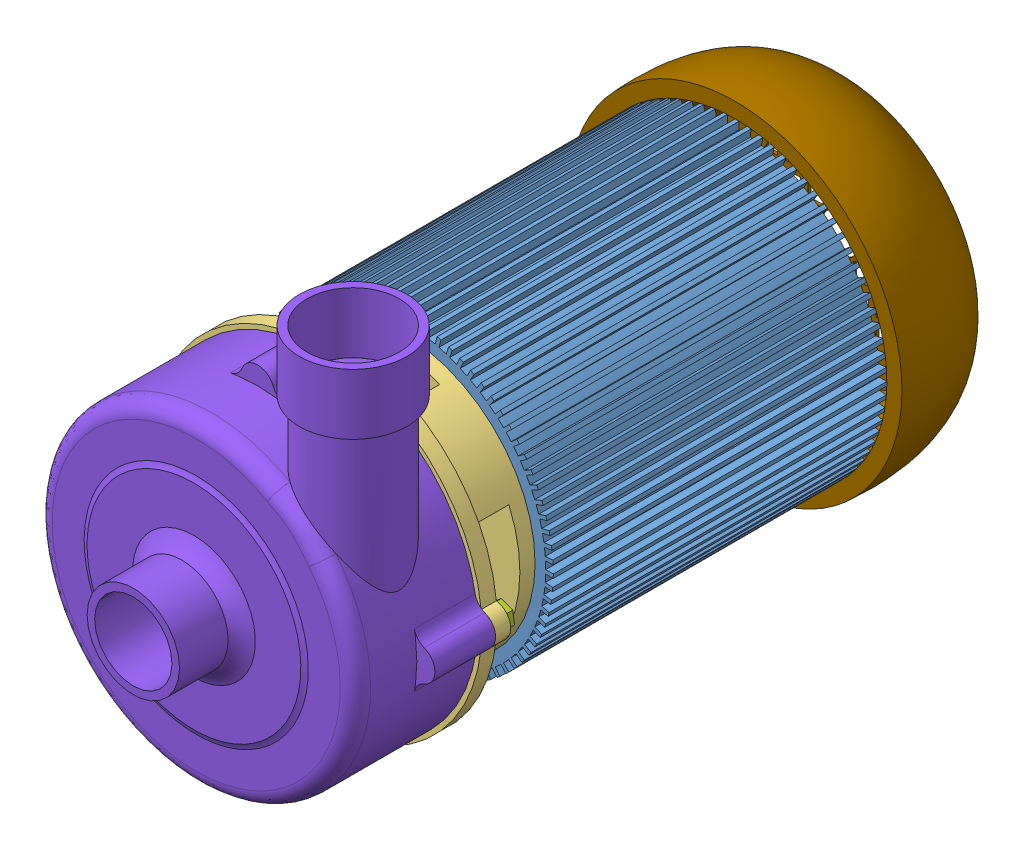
SolidWorks assembly BOMBA 5 HP.SLDASM, configuration Predeterminado (file format 4400). Lengths in mm.
Overall size (234 292 467).
16 component instances, 9 part files, 32 mates.
Components (placement in the parent):
- CARCASA MOTOR 5HP-1: CARCASA MOTOR 5HP.SLDPRT [Predeterminado] at (-10.3548 6.3831 -98.1182) size (200 200 243.76)
- EJE MOTOR 5 HP-1: EJE MOTOR 5 HP.SLDPRT [Predeterminado] at (-10.3548 6.3831 151.8818) x (-0.945086 0.326823 0) z (0 0 -1) size (35 35 180)
- PLATO SELLO 5 HP-1: PLATO SELLO 5 HP.SLDPRT [Predeterminado] at (-10.3548 6.3831 176.8818) x (-1 0 0) z (0 0 -1) size (234 234 65)
- TORNILLO MOTOR-1: TORNILLO MOTOR.SLDPRT [Predeterminado] at (-10.3548 64.3831 136.8818) x (-0.923728 -0.383049 0) z (0 0 -1) size (13.25 14.99 30)
- TORNILLO MOTOR-2: TORNILLO MOTOR.SLDPRT [Predeterminado] at (-68.3548 6.3831 136.8818) x (-0.923728 -0.383049 0) z (0 0 -1) size (13.25 14.99 30)
- TORNILLO MOTOR-3: TORNILLO MOTOR.SLDPRT [Predeterminado] at (-10.3548 -51.6169 136.8818) x (-0.95507 0.29638 0) z (0 0 -1) size (13.25 14.99 30)
- TORNILLO MOTOR-4: TORNILLO MOTOR.SLDPRT [Predeterminado] at (47.6452 6.3831 136.8818) x (-0.161135 0.986932 0) z (0 0 -1) size (13.25 14.99 30)
- SELLO MECANICO 5 HP-1: SELLO MECANICO 5 HP.SLDPRT [Predeterminado] at (-10.3548 6.3831 176.8818) size (25 25 5)
- RODETE 5 HP-1: RODETE 5 HP.SLDPRT [Predeterminado] at (-10.3548 6.3831 226.8818) x (-0.923728 -0.383049 0) z (0 0 -1) size (150 150 60)
- TORNILLO CARCASA MEDIA-1: TORNILLO CARCASA MEDIA.SLDPRT [Predeterminado] at (-10.3548 6.3831 193.8818) x (-0.923728 -0.383049 0) z (0 0 -1) size (14.9 15.82 31)
- CARCASA BOMBA 5HP-1: CARCASA BOMBA 5HP.SLDPRT [Predeterminado] at (-10.3548 6.3831 258.8818) x (-1 0 0) z (0 0 -1) size (234 292 122)
- TORNILLO CARCASA MEDIA-2: TORNILLO CARCASA MEDIA.SLDPRT [Predeterminado] at (-10.3548 112.3831 166.8818) size (14.9 15.82 31)
- TORNILLO CARCASA MEDIA-3: TORNILLO CARCASA MEDIA.SLDPRT [Predeterminado] at (-116.3548 6.3831 166.8818) size (14.9 15.82 31)
- TORNILLO CARCASA MEDIA-4: TORNILLO CARCASA MEDIA.SLDPRT [Predeterminado] at (-10.3548 -99.6169 166.8818) size (14.9 15.82 31)
- TORNILLO CARCASA MEDIA-5: TORNILLO CARCASA MEDIA.SLDPRT [Predeterminado] at (95.6452 6.3831 166.8818) size (14.9 15.82 31)
- TAPA TRASERA CARCASA MOTOR 5HP-1: TAPA TRASERA CARCASA MOTOR 5HP.SLDPRT [Predeterminado] at (-10.3548 6.3831 -98.1182) x (1 0 0) z (0 1 0) size (223.37 70 223.37)
Mates (geometry in assembly coordinates):
- Concéntrica1: concentric anti-aligned: cylinder of CARCASA MOTOR 5HP-1 through (-10.3548 6.3831 -98.1192) axis (0 0 1) radius 17.5; cylinder of EJE MOTOR 5 HP-1 through (-10.3548 6.3831 121.8818) axis (0 0 -1) radius 17.5
- Concéntrica2: concentric aligned: cylinder of EJE MOTOR 5 HP-1 through (-10.3548 6.3831 1.8818) axis (0 0 1) radius 12.5; cylinder of PLATO SELLO 5 HP-1 through (-10.3548 6.3831 121.8818) axis (0 0 1) radius 12.5
- Coincidente2: coincident aligned: plane of CARCASA MOTOR 5HP-1 through (-10.3548 6.3831 121.8818) normal (0 0 1); plane of EJE MOTOR 5 HP-1 through (-10.3548 6.3831 121.8818) normal (0 0 1)
- Concéntrica3: concentric anti-aligned: cylinder of CARCASA MOTOR 5HP-1 through (47.6452 6.3831 -98.1192) axis (0 0 1) radius 5; cylinder of PLATO SELLO 5 HP-1 through (47.6452 6.3831 131.8818) axis (0 0 -1) radius 5
- Coincidente3: coincident anti-aligned: plane of CARCASA MOTOR 5HP-1 through (-10.3548 6.3831 121.8818) normal (0 0 1); plane of PLATO SELLO 5 HP-1 through (-10.3548 6.3831 121.8818) normal (0 0 -1)
- Concéntrica4: concentric anti-aligned: cylinder of PLATO SELLO 5 HP-1 through (47.6452 6.3831 131.8818) axis (0 0 -1) radius 5; cylinder of TORNILLO MOTOR-4 through (47.6452 6.3831 106.8818) axis (0 0 1) radius 5
- Coincidente4: coincident anti-aligned: plane of PLATO SELLO 5 HP-1 through (24.6452 -110.6179 131.8818) normal (0 0 1); plane of TORNILLO MOTOR-4 through (55.0002 7.8509 131.8818) normal (0 0 -1)
- Concéntrica5: concentric anti-aligned: cylinder of PLATO SELLO 5 HP-1 through (-10.3548 64.3831 131.8818) axis (0 0 -1) radius 5; cylinder of TORNILLO MOTOR-1 through (-10.3548 64.3831 106.8818) axis (0 0 1) radius 5
- Coincidente5: coincident anti-aligned: plane of PLATO SELLO 5 HP-1 through (24.6452 -110.6179 131.8818) normal (0 0 1); plane of TORNILLO MOTOR-1 through (-13.4693 71.2058 131.8818) normal (0 0 -1)
- Concéntrica6: concentric anti-aligned: cylinder of PLATO SELLO 5 HP-1 through (-68.3548 6.3831 131.8818) axis (0 0 -1) radius 5; cylinder of TORNILLO MOTOR-2 through (-68.3548 6.3831 106.8818) axis (0 0 1) radius 5
- Coincidente6: coincident anti-aligned: plane of PLATO SELLO 5 HP-1 through (24.6452 -110.6179 131.8818) normal (0 0 1); plane of TORNILLO MOTOR-2 through (-71.4693 13.2058 131.8818) normal (0 0 -1)
- Concéntrica7: concentric anti-aligned: cylinder of PLATO SELLO 5 HP-1 through (-10.3548 -51.6169 131.8818) axis (0 0 -1) radius 5; cylinder of TORNILLO MOTOR-3 through (-10.3548 -51.6169 106.8818) axis (0 0 1) radius 5
- Coincidente7: coincident anti-aligned: plane of PLATO SELLO 5 HP-1 through (24.6452 -110.6179 131.8818) normal (0 0 1); plane of TORNILLO MOTOR-3 through (-8.385 -44.3802 131.8818) normal (0 0 -1)
- Concéntrica9: concentric aligned: cylinder of PLATO SELLO 5 HP-1 through (-10.3548 6.3831 181.8818) axis (0 0 -1) radius 12.5; cylinder of SELLO MECANICO 5 HP-1 through (-10.3548 6.3831 181.8818) axis (0 0 -1) radius 12.5
- Coincidente8: coincident aligned: plane of PLATO SELLO 5 HP-1 through (-10.3548 6.3831 181.8818) normal (0 0 1); plane of SELLO MECANICO 5 HP-1 through (-10.3548 6.3831 181.8818) normal (0 0 1)
- Concéntrica10: concentric anti-aligned: cylinder of EJE MOTOR 5 HP-1 through (-10.3548 6.3831 151.8818) axis (0 0 1) radius 6; cylinder of RODETE 5 HP-1 through (-10.3548 6.3831 241.8828) axis (0 0 -1) radius 7.5
- Coincidente9: coincident anti-aligned: plane of PLATO SELLO 5 HP-1 through (-10.3548 6.3831 181.8818) normal (0 0 1); plane of RODETE 5 HP-1 through (-10.3548 6.3831 181.8818) normal (0 0 -1)
- Concéntrica11: concentric aligned: cylinder of EJE MOTOR 5 HP-1 through (-10.3548 6.3831 151.8818) axis (0 0 1) radius 6; cylinder of TORNILLO CARCASA MEDIA-1 through (-10.3548 6.3831 168.8818) axis (0 0 1) radius 6.25
- Coincidente10: coincident anti-aligned: plane of RODETE 5 HP-1 through (-31.7245 112.5198 193.8818) normal (0 0 1); plane of TORNILLO CARCASA MEDIA-1 through (-12.2759 14.149 193.8818) normal (0 0 -1)
- Concéntrica12: concentric anti-aligned: cylinder of RODETE 5 HP-1 through (-10.3548 6.3831 181.8818) axis (0 0 1) radius 75; cylinder of CARCASA BOMBA 5HP-1 through (-10.3548 6.3831 256.8818) axis (0 0 -1) radius 92.5
- Concéntrica13: concentric anti-aligned: cylinder of PLATO SELLO 5 HP-1 through (-10.3548 112.3831 121.8808) axis (0 0 1) radius 6.25; cylinder of CARCASA BOMBA 5HP-1 through (-10.3548 112.3831 206.8818) axis (0 0 -1) radius 6.25
- Coincidente11: coincident anti-aligned: plane of PLATO SELLO 5 HP-1 through (-10.3548 6.3831 176.8818) normal (0 0 1); plane of CARCASA BOMBA 5HP-1 through (-10.3548 6.3831 176.8818) normal (0 0 -1)
- Concéntrica14: concentric aligned: cylinder of CARCASA BOMBA 5HP-1 through (-10.3548 112.3831 206.8818) axis (0 0 -1) radius 6.25; cylinder of TORNILLO CARCASA MEDIA-2 through (-10.3548 112.3831 191.8818) axis (0 0 -1) radius 6.25
- Coincidente12: coincident anti-aligned: plane of PLATO SELLO 5 HP-1 through (97.6452 6.3831 166.8818) normal (0 0 -1); plane of TORNILLO CARCASA MEDIA-2 through (-11.5549 120.2925 166.8818) normal (0 0 1)
- Concéntrica15: concentric aligned: cylinder of CARCASA BOMBA 5HP-1 through (-116.3548 6.3831 206.8818) axis (0 0 -1) radius 6.25; cylinder of TORNILLO CARCASA MEDIA-3 through (-116.3548 6.3831 191.8818) axis (0 0 -1) radius 6.25
- Coincidente13: coincident anti-aligned: plane of PLATO SELLO 5 HP-1 through (97.6452 6.3831 166.8818) normal (0 0 -1); plane of TORNILLO CARCASA MEDIA-3 through (-117.5549 14.2925 166.8818) normal (0 0 1)
- Concéntrica16: concentric anti-aligned: cylinder of PLATO SELLO 5 HP-1 through (-10.3548 -99.6169 121.8808) axis (0 0 1) radius 6.25; cylinder of TORNILLO CARCASA MEDIA-4 through (-10.3548 -99.6169 191.8818) axis (0 0 -1) radius 6.25
- Coincidente14: coincident anti-aligned: plane of PLATO SELLO 5 HP-1 through (97.6452 6.3831 166.8818) normal (0 0 -1); plane of TORNILLO CARCASA MEDIA-4 through (-11.5549 -91.7075 166.8818) normal (0 0 1)
- Concéntrica17: concentric anti-aligned: cylinder of PLATO SELLO 5 HP-1 through (95.6452 6.3831 121.8808) axis (0 0 1) radius 6.25; cylinder of TORNILLO CARCASA MEDIA-5 through (95.6452 6.3831 191.8818) axis (0 0 -1) radius 6.25
- Coincidente15: coincident anti-aligned: plane of PLATO SELLO 5 HP-1 through (97.6452 6.3831 166.8818) normal (0 0 -1); plane of TORNILLO CARCASA MEDIA-5 through (94.4451 14.2925 166.8818) normal (0 0 1)
- Concéntrica18: concentric anti-aligned: cylinder of CARCASA MOTOR 5HP-1 through (-10.3548 6.3831 106.8818) axis (0 0 -1) radius 90; circle of TAPA TRASERA CARCASA MOTOR 5HP-1
- Coincidente16: coincident anti-aligned: plane of CARCASA MOTOR 5HP-1 through (-10.3548 6.3831 -98.1182) normal (0 0 -1); plane of TAPA TRASERA CARCASA MOTOR 5HP-1 through (-120.3548 6.3831 -98.1182) normal (0 0 1)
